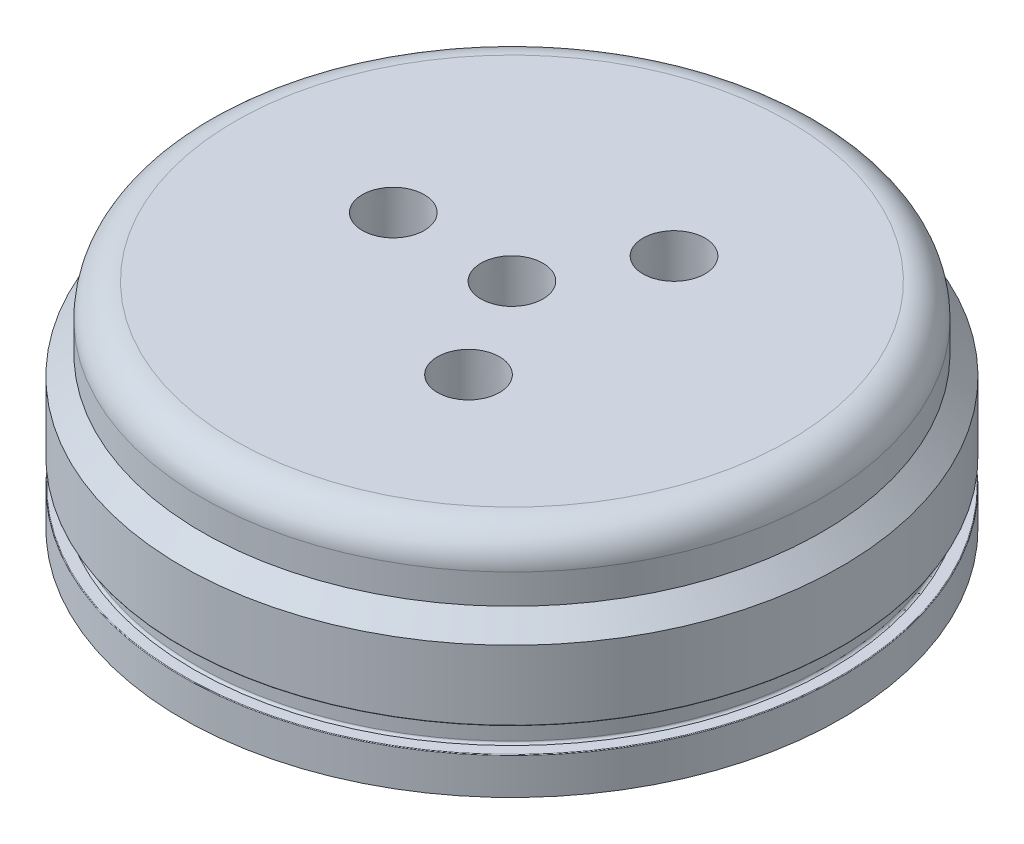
from build123d import *

# Parameters (mm, degrees)
CIRPATTERN1_COUNT              = 3
FILLET1_R                      = 6.35
F_8_32_TAPPED_HOLE1_AT_2_COUNT = 2
F_8_32_TAPPED_HOLE1_AT_2_PITCH = 19.05
CIRPATTERN3_COUNT              = 5


with BuildPart() as part:
    # Sketch1 → Revolve1 (revolve)
    with BuildSketch(Plane.XY, mode=Mode.PRIVATE) as revolve1_sk:
        with BuildLine():
            Line((-63.5, 0), (-63.5, 6.985))
            ThreePointArc((-63.5, 6.985), (-63.462802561, 7.074802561), (-63.373, 7.112))
            Line((-63.373, 7.112), (-61.3029, 7.112))
            ThreePointArc((-61.3029, 7.112), (-60.988591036, 7.242191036), (-60.8584, 7.5565))
            Line((-60.8584, 7.5565), (-60.8584, 11.4935))
            ThreePointArc((-60.8584, 11.4935), (-60.988591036, 11.807808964), (-61.3029, 11.938))
            Line((-61.3029, 11.938), (-63.373, 11.938))
            ThreePointArc((-63.373, 11.938), (-63.462802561, 11.975197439), (-63.5, 12.065))
            Line((-63.5, 12.065), (-63.5, 25.4))
            Line((-63.5, 25.4), (-59.69, 29.21))
            Line((-59.69, 29.21), (-59.69, 41.275))
            Line((-59.69, 41.275), (0, 41.275))
            Line((0, 41.275), (0, 32.385))
            Line((0, 32.385), (-47.042929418, 32.385))
            ThreePointArc((-47.042929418, 32.385), (-53.219839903, 29.826439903), (-55.7784, 23.649529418))
            Line((-55.7784, 23.649529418), (-55.7784, 0))
            Line((-55.7784, 0), (-63.5, 0))
        make_face()
    revolve(revolve1_sk.sketch.rotate(Axis((0, 0, 0), (0, 1, 0)), 270), axis=Axis((0, 0, 0), (0, 1, 0)))

    # Sketch2 → 1_4 NPT Tapped Hole1 (revolve, cut)
    with BuildSketch(Plane(origin=(-22.86, 32.385, 0), x_dir=(0, 0, -1), z_dir=(1, 0, 0))):
        Polygon((0, 0), (0, 8.89), (5.5626, 8.89), (5.5626, 10.033), (5.943680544, 10.033), (6.244082, 0), align=None)
    f_1_4_npt_tapped_hole1 = revolve(axis=Axis((-22.86, 26.035, 0), (0, 1, 0)), mode=Mode.SUBTRACT)

    # CirPattern1: 1_4 NPT Tapped Hole1 ×3 about axis
    cirpattern1_axis = Axis((0, 0, 0), (0, 1, 0))
    for i in range(1, CIRPATTERN1_COUNT):
        add(f_1_4_npt_tapped_hole1.rotate(cirpattern1_axis, i * 360 / CIRPATTERN1_COUNT), mode=Mode.SUBTRACT)

    # Fillet1
    fillet1_edges = [part.edges().sort_by_distance(p)[0] for p in [
        (0, 41.275, 59.69),
    ]]
    fillet(fillet1_edges, radius=FILLET1_R)

    # Sketch10 → 8-32 Tapped Hole1 (revolve, cut)
    with BuildSketch(Plane(origin=(-57.960057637, 0, -9.525), x_dir=(0, 0, -1), z_dir=(1, 0, 0))):
        Polygon((0, 0), (0, 13.331406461), (1.7272, 12.2936), (1.7272, 0), align=None)
    f_8_32_tapped_hole1 = revolve(axis=Axis((-57.960057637, -6.35, -9.525), (0, 1, 0)), mode=Mode.SUBTRACT)

    # 8-32 Tapped Hole1 at 2: 8-32 Tapped Hole1 ×2
    with Locations(*[(0, 0, i * F_8_32_TAPPED_HOLE1_AT_2_PITCH) for i in range(1, F_8_32_TAPPED_HOLE1_AT_2_COUNT)]):
        add(f_8_32_tapped_hole1, mode=Mode.SUBTRACT)

    # CirPattern3: 8-32 Tapped Hole1 ×5 about axis
    cirpattern3_axis = Axis((0, 0, 0), (0, 1, 0))
    for i in range(1, CIRPATTERN3_COUNT):
        add(f_8_32_tapped_hole1.rotate(cirpattern3_axis, i * 360 / CIRPATTERN3_COUNT), mode=Mode.SUBTRACT)

    # CirPattern3 copy 1 sketch → CirPattern3 copy 1 (revolve, cut)
    with BuildSketch(Plane(origin=(-8.851829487, 0, 58.066677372), x_dir=(-0.9510565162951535, 0, -0.30901699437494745), z_dir=(0.30901699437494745, 0, -0.9510565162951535))):
        Polygon((0, 0), (0, 13.331406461), (1.7272, 12.2936), (1.7272, 0), align=None)
    revolve(axis=Axis((-8.851829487, -6.35, 58.066677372), (0, 1, 0)), mode=Mode.SUBTRACT)

    # CirPattern3 copy 2 sketch → CirPattern3 copy 2 (revolve, cut)
    with BuildSketch(Plane(origin=(52.489326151, 0, 26.362180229), x_dir=(-0.5877852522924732, 0, 0.8090169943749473), z_dir=(-0.8090169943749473, 0, -0.5877852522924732))):
        Polygon((0, 0), (0, 13.331406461), (1.7272, 12.2936), (1.7272, 0), align=None)
    revolve(axis=Axis((52.489326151, -6.35, 26.362180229), (0, 1, 0)), mode=Mode.SUBTRACT)

    # CirPattern3 copy 3 sketch → CirPattern3 copy 3 (revolve, cut)
    with BuildSketch(Plane(origin=(41.292017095, 0, -41.773953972), x_dir=(0.587785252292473, 0, 0.8090169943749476), z_dir=(-0.8090169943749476, 0, 0.587785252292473))):
        Polygon((0, 0), (0, 13.331406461), (1.7272, 12.2936), (1.7272, 0), align=None)
    revolve(axis=Axis((41.292017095, -6.35, -41.773953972), (0, 1, 0)), mode=Mode.SUBTRACT)

    # CirPattern3 copy 4 sketch → CirPattern3 copy 4 (revolve, cut)
    with BuildSketch(Plane(origin=(-26.969456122, 0, -52.179903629), x_dir=(0.9510565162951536, 0, -0.30901699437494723), z_dir=(0.30901699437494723, 0, 0.9510565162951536))):
        Polygon((0, 0), (0, 13.331406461), (1.7272, 12.2936), (1.7272, 0), align=None)
    revolve(axis=Axis((-26.969456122, -6.35, -52.179903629), (0, 1, 0)), mode=Mode.SUBTRACT)

    # Sketch18 → 1_4 NPT Tapped Hole2 (revolve, cut)
    with BuildSketch(Plane(origin=(0, 32.385, 0), x_dir=(0, 0, -1), z_dir=(1, 0, 0))):
        Polygon((0, 0), (0, 8.89), (5.5626, 8.89), (5.5626, 10.033), (5.943680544, 10.033), (6.244082, 0), align=None)
    revolve(axis=Axis((0, 26.035, 0), (0, 1, 0)), mode=Mode.SUBTRACT)


solid = part.part
